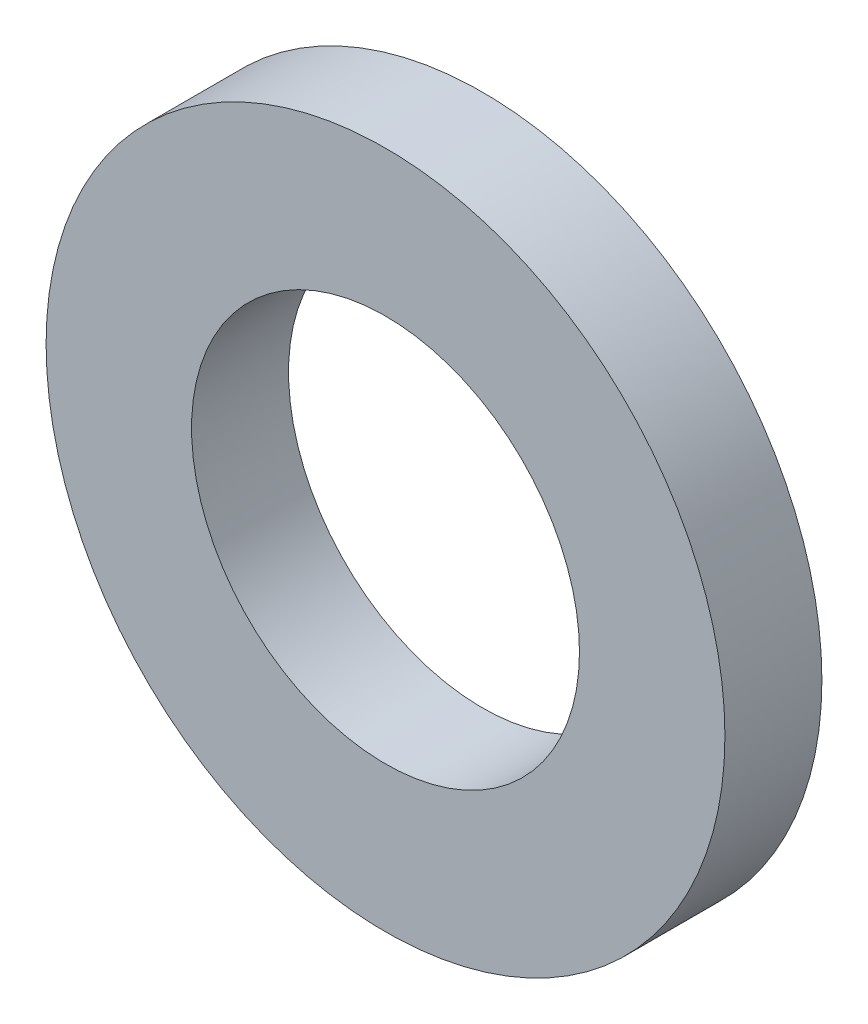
ISO-10303-21;
HEADER;
FILE_DESCRIPTION(('STEP AP214'),'2;1');
FILE_NAME('part.step','',(''),(''),'','','');
FILE_SCHEMA(('AUTOMOTIVE_DESIGN { 1 0 10303 214 1 1 1 1 }'));
ENDSEC;
DATA;
#1=APPLICATION_CONTEXT('core data for automotive mechanical design processes');
#2=APPLICATION_PROTOCOL_DEFINITION('international standard','automotive_design',2000,#1);
#3=PRODUCT_CONTEXT('',#1,'mechanical');
#4=PRODUCT('Part','Part','',(#3));
#5=PRODUCT_RELATED_PRODUCT_CATEGORY('part','',(#4));
#6=PRODUCT_DEFINITION_FORMATION('','',#4);
#7=PRODUCT_DEFINITION_CONTEXT('part definition',#1,'design');
#8=PRODUCT_DEFINITION('design','',#6,#7);
#9=PRODUCT_DEFINITION_SHAPE('','',#8);
#10=(LENGTH_UNIT() NAMED_UNIT(*) SI_UNIT(.MILLI.,.METRE.));
#11=(NAMED_UNIT(*) PLANE_ANGLE_UNIT() SI_UNIT($,.RADIAN.));
#12=(NAMED_UNIT(*) SI_UNIT($,.STERADIAN.) SOLID_ANGLE_UNIT());
#13=UNCERTAINTY_MEASURE_WITH_UNIT(LENGTH_MEASURE(1.E-05),#10,'distance_accuracy_value','');
#14=(GEOMETRIC_REPRESENTATION_CONTEXT(3) GLOBAL_UNCERTAINTY_ASSIGNED_CONTEXT((#13)) GLOBAL_UNIT_ASSIGNED_CONTEXT((#10,
#11,#12)) REPRESENTATION_CONTEXT('',''));
#15=CARTESIAN_POINT('',(0.,0.,0.));
#16=DIRECTION('',(0.,0.,1.));
#17=DIRECTION('',(1.,0.,0.));
#18=AXIS2_PLACEMENT_3D('',#15,#16,#17);
#19=CARTESIAN_POINT('',(0.,0.,6.35));
#20=DIRECTION('',(0.,0.,1.));
#21=DIRECTION('',(1.,0.,0.));
#22=AXIS2_PLACEMENT_3D('',#19,#20,#21);
#23=PLANE('',#22);
#24=CARTESIAN_POINT('',(0.,0.,6.35));
#25=DIRECTION('',(0.,0.,1.));
#26=DIRECTION('',(1.,0.,0.));
#27=AXIS2_PLACEMENT_3D('',#24,#25,#26);
#28=CIRCLE('',#27,44.45);
#29=CARTESIAN_POINT('',(44.45,0.,6.35));
#30=VERTEX_POINT('',#29);
#31=EDGE_CURVE('E10',#30,#30,#28,.T.);
#32=ORIENTED_EDGE('',*,*,#31,.T.);
#33=EDGE_LOOP('',(#32));
#34=FACE_BOUND('',#33,.T.);
#35=CARTESIAN_POINT('',(0.,0.,6.35));
#36=DIRECTION('',(0.,0.,1.));
#37=DIRECTION('',(1.,0.,0.));
#38=AXIS2_PLACEMENT_3D('',#35,#36,#37);
#39=CIRCLE('',#38,25.4);
#40=CARTESIAN_POINT('',(25.4,0.,6.35));
#41=VERTEX_POINT('',#40);
#42=EDGE_CURVE('E45',#41,#41,#39,.T.);
#43=ORIENTED_EDGE('',*,*,#42,.F.);
#44=EDGE_LOOP('',(#43));
#45=FACE_BOUND('',#44,.T.);
#46=ADVANCED_FACE('F34',(#34,#45),#23,.T.);
#47=CARTESIAN_POINT('',(0.,0.,-6.35));
#48=DIRECTION('',(0.,0.,1.));
#49=DIRECTION('',(1.,0.,0.));
#50=AXIS2_PLACEMENT_3D('',#47,#48,#49);
#51=PLANE('',#50);
#52=CARTESIAN_POINT('',(0.,0.,-6.35));
#53=DIRECTION('',(0.,0.,1.));
#54=DIRECTION('',(1.,0.,0.));
#55=AXIS2_PLACEMENT_3D('',#52,#53,#54);
#56=CIRCLE('',#55,44.45);
#57=CARTESIAN_POINT('',(44.45,0.,-6.35));
#58=VERTEX_POINT('',#57);
#59=EDGE_CURVE('E41',#58,#58,#56,.T.);
#60=ORIENTED_EDGE('',*,*,#59,.F.);
#61=EDGE_LOOP('',(#60));
#62=FACE_BOUND('',#61,.T.);
#63=CARTESIAN_POINT('',(0.,0.,-6.35));
#64=DIRECTION('',(0.,0.,1.));
#65=DIRECTION('',(1.,0.,0.));
#66=AXIS2_PLACEMENT_3D('',#63,#64,#65);
#67=CIRCLE('',#66,25.4);
#68=CARTESIAN_POINT('',(25.4,0.,-6.35));
#69=VERTEX_POINT('',#68);
#70=EDGE_CURVE('E49',#69,#69,#67,.T.);
#71=ORIENTED_EDGE('',*,*,#70,.T.);
#72=EDGE_LOOP('',(#71));
#73=FACE_BOUND('',#72,.T.);
#74=ADVANCED_FACE('F55',(#62,#73),#51,.F.);
#75=CARTESIAN_POINT('',(0.,0.,6.35));
#76=DIRECTION('',(0.,0.,-1.));
#77=DIRECTION('',(-1.,0.,0.));
#78=AXIS2_PLACEMENT_3D('',#75,#76,#77);
#79=CYLINDRICAL_SURFACE('',#78,44.45);
#80=ORIENTED_EDGE('',*,*,#31,.F.);
#81=EDGE_LOOP('',(#80));
#82=FACE_BOUND('',#81,.T.);
#83=ORIENTED_EDGE('',*,*,#59,.T.);
#84=EDGE_LOOP('',(#83));
#85=FACE_BOUND('',#84,.T.);
#86=ADVANCED_FACE('F36',(#82,#85),#79,.T.);
#87=CARTESIAN_POINT('',(0.,0.,6.35));
#88=DIRECTION('',(0.,0.,-1.));
#89=DIRECTION('',(-1.,0.,0.));
#90=AXIS2_PLACEMENT_3D('',#87,#88,#89);
#91=CYLINDRICAL_SURFACE('',#90,25.4);
#92=ORIENTED_EDGE('',*,*,#42,.T.);
#93=EDGE_LOOP('',(#92));
#94=FACE_BOUND('',#93,.T.);
#95=ORIENTED_EDGE('',*,*,#70,.F.);
#96=EDGE_LOOP('',(#95));
#97=FACE_BOUND('',#96,.T.);
#98=ADVANCED_FACE('F57',(#94,#97),#91,.F.);
#99=CLOSED_SHELL('',(#46,#74,#86,#98));
#100=MANIFOLD_SOLID_BREP('B2',#99);
#101=ADVANCED_BREP_SHAPE_REPRESENTATION('',(#18,#100),#14);
#102=SHAPE_DEFINITION_REPRESENTATION(#9,#101);
ENDSEC;
END-ISO-10303-21;
